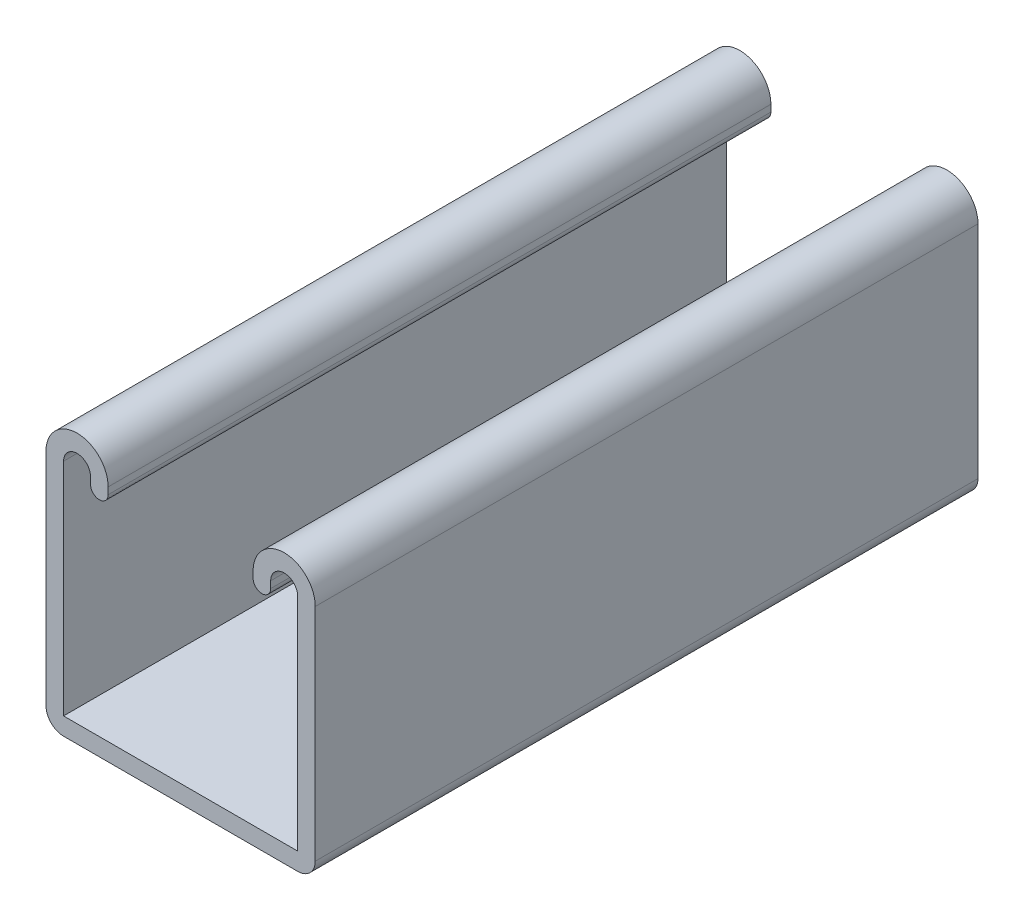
ISO-10303-21;
HEADER;
FILE_DESCRIPTION(('STEP AP214'),'2;1');
FILE_NAME('part.step','',(''),(''),'','','');
FILE_SCHEMA(('AUTOMOTIVE_DESIGN { 1 0 10303 214 1 1 1 1 }'));
ENDSEC;
DATA;
#1=APPLICATION_CONTEXT('core data for automotive mechanical design processes');
#2=APPLICATION_PROTOCOL_DEFINITION('international standard','automotive_design',2000,#1);
#3=PRODUCT_CONTEXT('',#1,'mechanical');
#4=PRODUCT('Part','Part','',(#3));
#5=PRODUCT_RELATED_PRODUCT_CATEGORY('part','',(#4));
#6=PRODUCT_DEFINITION_FORMATION('','',#4);
#7=PRODUCT_DEFINITION_CONTEXT('part definition',#1,'design');
#8=PRODUCT_DEFINITION('design','',#6,#7);
#9=PRODUCT_DEFINITION_SHAPE('','',#8);
#10=(LENGTH_UNIT() NAMED_UNIT(*) SI_UNIT(.MILLI.,.METRE.));
#11=(NAMED_UNIT(*) PLANE_ANGLE_UNIT() SI_UNIT($,.RADIAN.));
#12=(NAMED_UNIT(*) SI_UNIT($,.STERADIAN.) SOLID_ANGLE_UNIT());
#13=UNCERTAINTY_MEASURE_WITH_UNIT(LENGTH_MEASURE(1.E-05),#10,'distance_accuracy_value','');
#14=(GEOMETRIC_REPRESENTATION_CONTEXT(3) GLOBAL_UNCERTAINTY_ASSIGNED_CONTEXT((#13)) GLOBAL_UNIT_ASSIGNED_CONTEXT((#10,
#11,#12)) REPRESENTATION_CONTEXT('',''));
#15=CARTESIAN_POINT('',(0.,0.,0.));
#16=DIRECTION('',(0.,0.,1.));
#17=DIRECTION('',(1.,0.,0.));
#18=AXIS2_PLACEMENT_3D('',#15,#16,#17);
#19=CARTESIAN_POINT('',(-15.875,18.4785,101.6));
#20=DIRECTION('',(0.,0.,-1.));
#21=DIRECTION('',(-1.,0.,0.));
#22=AXIS2_PLACEMENT_3D('',#19,#20,#21);
#23=CYLINDRICAL_SURFACE('',#22,4.7625);
#24=CARTESIAN_POINT('',(-15.875,18.4785,0.));
#25=DIRECTION('',(0.,0.,1.));
#26=DIRECTION('',(-1.,0.,0.));
#27=AXIS2_PLACEMENT_3D('',#24,#25,#26);
#28=CIRCLE('',#27,4.7625);
#29=CARTESIAN_POINT('',(-11.1125,18.4785,0.));
#30=VERTEX_POINT('',#29);
#31=CARTESIAN_POINT('',(-20.6375,18.4785,0.));
#32=VERTEX_POINT('',#31);
#33=EDGE_CURVE('E190',#30,#32,#28,.T.);
#34=ORIENTED_EDGE('',*,*,#33,.T.);
#35=DIRECTION('',(0.,0.,-1.));
#36=VECTOR('',#35,1.);
#37=CARTESIAN_POINT('',(-20.6375,18.4785,101.6));
#38=LINE('',#37,#36);
#39=CARTESIAN_POINT('',(-20.6375,18.4785,101.6));
#40=VERTEX_POINT('',#39);
#41=EDGE_CURVE('E11',#40,#32,#38,.T.);
#42=ORIENTED_EDGE('',*,*,#41,.F.);
#43=CARTESIAN_POINT('',(-15.875,18.4785,101.6));
#44=DIRECTION('',(0.,0.,1.));
#45=DIRECTION('',(-1.,0.,0.));
#46=AXIS2_PLACEMENT_3D('',#43,#44,#45);
#47=CIRCLE('',#46,4.7625);
#48=CARTESIAN_POINT('',(-11.1125,18.4785,101.6));
#49=VERTEX_POINT('',#48);
#50=EDGE_CURVE('E224',#49,#40,#47,.T.);
#51=ORIENTED_EDGE('',*,*,#50,.F.);
#52=DIRECTION('',(0.,0.,-1.));
#53=VECTOR('',#52,1.);
#54=CARTESIAN_POINT('',(-11.1125,18.4785,101.6));
#55=LINE('',#54,#53);
#56=EDGE_CURVE('E186',#49,#30,#55,.T.);
#57=ORIENTED_EDGE('',*,*,#56,.T.);
#58=EDGE_LOOP('',(#34,#42,#51,#57));
#59=FACE_BOUND('',#58,.T.);
#60=ADVANCED_FACE('F33',(#59),#23,.T.);
#61=CARTESIAN_POINT('',(-20.6375,18.4785,101.6));
#62=DIRECTION('',(1.,0.,0.));
#63=DIRECTION('',(0.,1.,0.));
#64=AXIS2_PLACEMENT_3D('',#61,#62,#63);
#65=PLANE('',#64);
#66=DIRECTION('',(0.,-1.,0.));
#67=VECTOR('',#66,1.);
#68=CARTESIAN_POINT('',(-20.6375,18.4785,0.));
#69=LINE('',#68,#67);
#70=CARTESIAN_POINT('',(-20.6375,-15.3416,0.));
#71=VERTEX_POINT('',#70);
#72=EDGE_CURVE('E193',#32,#71,#69,.T.);
#73=ORIENTED_EDGE('',*,*,#72,.T.);
#74=DIRECTION('',(0.,0.,-1.));
#75=VECTOR('',#74,1.);
#76=CARTESIAN_POINT('',(-20.6375,-15.3416,101.6));
#77=LINE('',#76,#75);
#78=CARTESIAN_POINT('',(-20.6375,-15.3416,101.6));
#79=VERTEX_POINT('',#78);
#80=EDGE_CURVE('E42',#79,#71,#77,.T.);
#81=ORIENTED_EDGE('',*,*,#80,.F.);
#82=DIRECTION('',(0.,-1.,0.));
#83=VECTOR('',#82,1.);
#84=CARTESIAN_POINT('',(-20.6375,18.4785,101.6));
#85=LINE('',#84,#83);
#86=EDGE_CURVE('E123',#40,#79,#85,.T.);
#87=ORIENTED_EDGE('',*,*,#86,.F.);
#88=ORIENTED_EDGE('',*,*,#41,.T.);
#89=EDGE_LOOP('',(#73,#81,#87,#88));
#90=FACE_BOUND('',#89,.T.);
#91=ADVANCED_FACE('F333',(#90),#65,.F.);
#92=CARTESIAN_POINT('',(-17.9451,-15.3416,101.6));
#93=DIRECTION('',(0.,0.,-1.));
#94=DIRECTION('',(-1.,0.,0.));
#95=AXIS2_PLACEMENT_3D('',#92,#93,#94);
#96=CYLINDRICAL_SURFACE('',#95,2.6924);
#97=CARTESIAN_POINT('',(-17.9451,-15.3416,0.));
#98=DIRECTION('',(0.,0.,1.));
#99=DIRECTION('',(-1.,0.,0.));
#100=AXIS2_PLACEMENT_3D('',#97,#98,#99);
#101=CIRCLE('',#100,2.6924);
#102=CARTESIAN_POINT('',(-17.9451,-18.034,0.));
#103=VERTEX_POINT('',#102);
#104=EDGE_CURVE('E195',#71,#103,#101,.T.);
#105=ORIENTED_EDGE('',*,*,#104,.T.);
#106=DIRECTION('',(0.,0.,-1.));
#107=VECTOR('',#106,1.);
#108=CARTESIAN_POINT('',(-17.9451,-18.034,101.6));
#109=LINE('',#108,#107);
#110=CARTESIAN_POINT('',(-17.9451,-18.034,101.6));
#111=VERTEX_POINT('',#110);
#112=EDGE_CURVE('E261',#111,#103,#109,.T.);
#113=ORIENTED_EDGE('',*,*,#112,.F.);
#114=CARTESIAN_POINT('',(-17.9451,-15.3416,101.6));
#115=DIRECTION('',(0.,0.,1.));
#116=DIRECTION('',(-1.,0.,0.));
#117=AXIS2_PLACEMENT_3D('',#114,#115,#116);
#118=CIRCLE('',#117,2.6924);
#119=EDGE_CURVE('E270',#79,#111,#118,.T.);
#120=ORIENTED_EDGE('',*,*,#119,.F.);
#121=ORIENTED_EDGE('',*,*,#80,.T.);
#122=EDGE_LOOP('',(#105,#113,#120,#121));
#123=FACE_BOUND('',#122,.T.);
#124=ADVANCED_FACE('F268',(#123),#96,.T.);
#125=CARTESIAN_POINT('',(-17.9451,-18.034,101.6));
#126=DIRECTION('',(0.,1.,0.));
#127=DIRECTION('',(-1.,0.,0.));
#128=AXIS2_PLACEMENT_3D('',#125,#126,#127);
#129=PLANE('',#128);
#130=CARTESIAN_POINT('',(0.,-18.034,71.4375));
#131=DIRECTION('',(0.,-1.,0.));
#132=DIRECTION('',(1.,0.,0.));
#133=AXIS2_PLACEMENT_3D('',#130,#131,#132);
#134=CIRCLE('',#133,7.14375);
#135=CARTESIAN_POINT('',(7.14375,-18.034,71.4375));
#136=VERTEX_POINT('',#135);
#137=EDGE_CURVE('E452',#136,#136,#134,.T.);
#138=ORIENTED_EDGE('',*,*,#137,.F.);
#139=EDGE_LOOP('',(#138));
#140=FACE_BOUND('',#139,.T.);
#141=CARTESIAN_POINT('',(0.,-18.034,23.8125));
#142=DIRECTION('',(0.,-1.,0.));
#143=DIRECTION('',(1.,0.,0.));
#144=AXIS2_PLACEMENT_3D('',#141,#142,#143);
#145=CIRCLE('',#144,7.14375);
#146=CARTESIAN_POINT('',(7.14375,-18.034,23.8125));
#147=VERTEX_POINT('',#146);
#148=EDGE_CURVE('E456',#147,#147,#145,.T.);
#149=ORIENTED_EDGE('',*,*,#148,.F.);
#150=EDGE_LOOP('',(#149));
#151=FACE_BOUND('',#150,.T.);
#152=DIRECTION('',(1.,0.,0.));
#153=VECTOR('',#152,1.);
#154=CARTESIAN_POINT('',(-17.9451,-18.034,0.));
#155=LINE('',#154,#153);
#156=CARTESIAN_POINT('',(17.9451,-18.034,0.));
#157=VERTEX_POINT('',#156);
#158=EDGE_CURVE('E197',#103,#157,#155,.T.);
#159=ORIENTED_EDGE('',*,*,#158,.T.);
#160=DIRECTION('',(0.,0.,-1.));
#161=VECTOR('',#160,1.);
#162=CARTESIAN_POINT('',(17.9451,-18.034,101.6));
#163=LINE('',#162,#161);
#164=CARTESIAN_POINT('',(17.9451,-18.034,101.6));
#165=VERTEX_POINT('',#164);
#166=EDGE_CURVE('E258',#165,#157,#163,.T.);
#167=ORIENTED_EDGE('',*,*,#166,.F.);
#168=DIRECTION('',(1.,0.,0.));
#169=VECTOR('',#168,1.);
#170=CARTESIAN_POINT('',(-17.9451,-18.034,101.6));
#171=LINE('',#170,#169);
#172=EDGE_CURVE('E288',#111,#165,#171,.T.);
#173=ORIENTED_EDGE('',*,*,#172,.F.);
#174=ORIENTED_EDGE('',*,*,#112,.T.);
#175=EDGE_LOOP('',(#159,#167,#173,#174));
#176=FACE_BOUND('',#175,.T.);
#177=ADVANCED_FACE('F279',(#140,#151,#176),#129,.F.);
#178=CARTESIAN_POINT('',(17.9451,-15.3416,101.6));
#179=DIRECTION('',(0.,0.,-1.));
#180=DIRECTION('',(-1.,0.,0.));
#181=AXIS2_PLACEMENT_3D('',#178,#179,#180);
#182=CYLINDRICAL_SURFACE('',#181,2.6924);
#183=CARTESIAN_POINT('',(17.9451,-15.3416,0.));
#184=DIRECTION('',(0.,0.,1.));
#185=DIRECTION('',(1.,0.,0.));
#186=AXIS2_PLACEMENT_3D('',#183,#184,#185);
#187=CIRCLE('',#186,2.6924);
#188=CARTESIAN_POINT('',(20.6375,-15.3416,0.));
#189=VERTEX_POINT('',#188);
#190=EDGE_CURVE('E199',#157,#189,#187,.T.);
#191=ORIENTED_EDGE('',*,*,#190,.T.);
#192=DIRECTION('',(0.,0.,-1.));
#193=VECTOR('',#192,1.);
#194=CARTESIAN_POINT('',(20.6375,-15.3416,101.6));
#195=LINE('',#194,#193);
#196=CARTESIAN_POINT('',(20.6375,-15.3416,101.6));
#197=VERTEX_POINT('',#196);
#198=EDGE_CURVE('E255',#197,#189,#195,.T.);
#199=ORIENTED_EDGE('',*,*,#198,.F.);
#200=CARTESIAN_POINT('',(17.9451,-15.3416,101.6));
#201=DIRECTION('',(0.,0.,1.));
#202=DIRECTION('',(1.,0.,0.));
#203=AXIS2_PLACEMENT_3D('',#200,#201,#202);
#204=CIRCLE('',#203,2.6924);
#205=EDGE_CURVE('E285',#165,#197,#204,.T.);
#206=ORIENTED_EDGE('',*,*,#205,.F.);
#207=ORIENTED_EDGE('',*,*,#166,.T.);
#208=EDGE_LOOP('',(#191,#199,#206,#207));
#209=FACE_BOUND('',#208,.T.);
#210=ADVANCED_FACE('F283',(#209),#182,.T.);
#211=CARTESIAN_POINT('',(20.6375,-15.3416,101.6));
#212=DIRECTION('',(-1.,0.,0.));
#213=DIRECTION('',(0.,0.,1.));
#214=AXIS2_PLACEMENT_3D('',#211,#212,#213);
#215=PLANE('',#214);
#216=DIRECTION('',(0.,1.,0.));
#217=VECTOR('',#216,1.);
#218=CARTESIAN_POINT('',(20.6375,-15.3416,0.));
#219=LINE('',#218,#217);
#220=CARTESIAN_POINT('',(20.6375,18.4785,0.));
#221=VERTEX_POINT('',#220);
#222=EDGE_CURVE('E201',#189,#221,#219,.T.);
#223=ORIENTED_EDGE('',*,*,#222,.T.);
#224=DIRECTION('',(0.,0.,-1.));
#225=VECTOR('',#224,1.);
#226=CARTESIAN_POINT('',(20.6375,18.4785,101.6));
#227=LINE('',#226,#225);
#228=CARTESIAN_POINT('',(20.6375,18.4785,101.6));
#229=VERTEX_POINT('',#228);
#230=EDGE_CURVE('E252',#229,#221,#227,.T.);
#231=ORIENTED_EDGE('',*,*,#230,.F.);
#232=DIRECTION('',(0.,1.,0.));
#233=VECTOR('',#232,1.);
#234=CARTESIAN_POINT('',(20.6375,-15.3416,101.6));
#235=LINE('',#234,#233);
#236=EDGE_CURVE('E287',#197,#229,#235,.T.);
#237=ORIENTED_EDGE('',*,*,#236,.F.);
#238=ORIENTED_EDGE('',*,*,#198,.T.);
#239=EDGE_LOOP('',(#223,#231,#237,#238));
#240=FACE_BOUND('',#239,.T.);
#241=ADVANCED_FACE('F347',(#240),#215,.F.);
#242=CARTESIAN_POINT('',(15.875,18.4785,101.6));
#243=DIRECTION('',(0.,0.,-1.));
#244=DIRECTION('',(-1.,0.,0.));
#245=AXIS2_PLACEMENT_3D('',#242,#243,#244);
#246=CYLINDRICAL_SURFACE('',#245,4.7625);
#247=CARTESIAN_POINT('',(15.875,18.4785,0.));
#248=DIRECTION('',(0.,0.,1.));
#249=DIRECTION('',(1.,0.,0.));
#250=AXIS2_PLACEMENT_3D('',#247,#248,#249);
#251=CIRCLE('',#250,4.7625);
#252=CARTESIAN_POINT('',(11.1125,18.4785,0.));
#253=VERTEX_POINT('',#252);
#254=EDGE_CURVE('E203',#221,#253,#251,.T.);
#255=ORIENTED_EDGE('',*,*,#254,.T.);
#256=DIRECTION('',(0.,0.,-1.));
#257=VECTOR('',#256,1.);
#258=CARTESIAN_POINT('',(11.1125,18.4785,101.6));
#259=LINE('',#258,#257);
#260=CARTESIAN_POINT('',(11.1125,18.4785,101.6));
#261=VERTEX_POINT('',#260);
#262=EDGE_CURVE('E249',#261,#253,#259,.T.);
#263=ORIENTED_EDGE('',*,*,#262,.F.);
#264=CARTESIAN_POINT('',(15.875,18.4785,101.6));
#265=DIRECTION('',(0.,0.,1.));
#266=DIRECTION('',(1.,0.,0.));
#267=AXIS2_PLACEMENT_3D('',#264,#265,#266);
#268=CIRCLE('',#267,4.7625);
#269=EDGE_CURVE('E290',#229,#261,#268,.T.);
#270=ORIENTED_EDGE('',*,*,#269,.F.);
#271=ORIENTED_EDGE('',*,*,#230,.T.);
#272=EDGE_LOOP('',(#255,#263,#270,#271));
#273=FACE_BOUND('',#272,.T.);
#274=ADVANCED_FACE('F350',(#273),#246,.T.);
#275=CARTESIAN_POINT('',(11.1125,18.4785,101.6));
#276=DIRECTION('',(1.,0.,0.));
#277=DIRECTION('',(0.,1.,0.));
#278=AXIS2_PLACEMENT_3D('',#275,#276,#277);
#279=PLANE('',#278);
#280=DIRECTION('',(0.,-1.,0.));
#281=VECTOR('',#280,1.);
#282=CARTESIAN_POINT('',(11.1125,18.4785,0.));
#283=LINE('',#282,#281);
#284=CARTESIAN_POINT('',(11.1125,17.44345,0.));
#285=VERTEX_POINT('',#284);
#286=EDGE_CURVE('E205',#253,#285,#283,.T.);
#287=ORIENTED_EDGE('',*,*,#286,.T.);
#288=DIRECTION('',(0.,0.,-1.));
#289=VECTOR('',#288,1.);
#290=CARTESIAN_POINT('',(11.1125,17.44345,101.6));
#291=LINE('',#290,#289);
#292=CARTESIAN_POINT('',(11.1125,17.44345,101.6));
#293=VERTEX_POINT('',#292);
#294=EDGE_CURVE('E246',#293,#285,#291,.T.);
#295=ORIENTED_EDGE('',*,*,#294,.F.);
#296=DIRECTION('',(0.,-1.,0.));
#297=VECTOR('',#296,1.);
#298=CARTESIAN_POINT('',(11.1125,18.4785,101.6));
#299=LINE('',#298,#297);
#300=EDGE_CURVE('E296',#261,#293,#299,.T.);
#301=ORIENTED_EDGE('',*,*,#300,.F.);
#302=ORIENTED_EDGE('',*,*,#262,.T.);
#303=EDGE_LOOP('',(#287,#295,#301,#302));
#304=FACE_BOUND('',#303,.T.);
#305=ADVANCED_FACE('F354',(#304),#279,.F.);
#306=CARTESIAN_POINT('',(12.4587,17.44345,101.6));
#307=DIRECTION('',(0.,0.,-1.));
#308=DIRECTION('',(-1.,0.,0.));
#309=AXIS2_PLACEMENT_3D('',#306,#307,#308);
#310=CYLINDRICAL_SURFACE('',#309,1.3462);
#311=CARTESIAN_POINT('',(12.4587,17.44345,0.));
#312=DIRECTION('',(0.,0.,1.));
#313=DIRECTION('',(1.,0.,0.));
#314=AXIS2_PLACEMENT_3D('',#311,#312,#313);
#315=CIRCLE('',#314,1.3462);
#316=CARTESIAN_POINT('',(13.8049,17.44345,0.));
#317=VERTEX_POINT('',#316);
#318=EDGE_CURVE('E207',#285,#317,#315,.T.);
#319=ORIENTED_EDGE('',*,*,#318,.T.);
#320=DIRECTION('',(0.,0.,-1.));
#321=VECTOR('',#320,1.);
#322=CARTESIAN_POINT('',(13.8049,17.44345,101.6));
#323=LINE('',#322,#321);
#324=CARTESIAN_POINT('',(13.8049,17.44345,101.6));
#325=VERTEX_POINT('',#324);
#326=EDGE_CURVE('E243',#325,#317,#323,.T.);
#327=ORIENTED_EDGE('',*,*,#326,.F.);
#328=CARTESIAN_POINT('',(12.4587,17.44345,101.6));
#329=DIRECTION('',(0.,0.,1.));
#330=DIRECTION('',(1.,0.,0.));
#331=AXIS2_PLACEMENT_3D('',#328,#329,#330);
#332=CIRCLE('',#331,1.3462);
#333=EDGE_CURVE('E298',#293,#325,#332,.T.);
#334=ORIENTED_EDGE('',*,*,#333,.F.);
#335=ORIENTED_EDGE('',*,*,#294,.T.);
#336=EDGE_LOOP('',(#319,#327,#334,#335));
#337=FACE_BOUND('',#336,.T.);
#338=ADVANCED_FACE('F358',(#337),#310,.T.);
#339=CARTESIAN_POINT('',(13.8049,18.4785,101.6));
#340=DIRECTION('',(-1.,0.,0.));
#341=DIRECTION('',(0.,0.,1.));
#342=AXIS2_PLACEMENT_3D('',#339,#340,#341);
#343=PLANE('',#342);
#344=DIRECTION('',(0.,1.,0.));
#345=VECTOR('',#344,1.);
#346=CARTESIAN_POINT('',(13.8049,18.4785,0.));
#347=LINE('',#346,#345);
#348=CARTESIAN_POINT('',(13.8049,18.4785,0.));
#349=VERTEX_POINT('',#348);
#350=EDGE_CURVE('E209',#317,#349,#347,.T.);
#351=ORIENTED_EDGE('',*,*,#350,.T.);
#352=DIRECTION('',(0.,0.,-1.));
#353=VECTOR('',#352,1.);
#354=CARTESIAN_POINT('',(13.8049,18.4785,101.6));
#355=LINE('',#354,#353);
#356=CARTESIAN_POINT('',(13.8049,18.4785,101.6));
#357=VERTEX_POINT('',#356);
#358=EDGE_CURVE('E240',#357,#349,#355,.T.);
#359=ORIENTED_EDGE('',*,*,#358,.F.);
#360=DIRECTION('',(0.,1.,0.));
#361=VECTOR('',#360,1.);
#362=CARTESIAN_POINT('',(13.8049,18.4785,101.6));
#363=LINE('',#362,#361);
#364=EDGE_CURVE('E300',#325,#357,#363,.T.);
#365=ORIENTED_EDGE('',*,*,#364,.F.);
#366=ORIENTED_EDGE('',*,*,#326,.T.);
#367=EDGE_LOOP('',(#351,#359,#365,#366));
#368=FACE_BOUND('',#367,.T.);
#369=ADVANCED_FACE('F362',(#368),#343,.F.);
#370=CARTESIAN_POINT('',(15.875,18.4785,101.6));
#371=DIRECTION('',(0.,0.,-1.));
#372=DIRECTION('',(-1.,0.,0.));
#373=AXIS2_PLACEMENT_3D('',#370,#371,#372);
#374=CYLINDRICAL_SURFACE('',#373,2.0701);
#375=CARTESIAN_POINT('',(15.875,18.4785,0.));
#376=DIRECTION('',(0.,0.,-1.));
#377=DIRECTION('',(1.,0.,0.));
#378=AXIS2_PLACEMENT_3D('',#375,#376,#377);
#379=CIRCLE('',#378,2.0701);
#380=CARTESIAN_POINT('',(17.9451,18.4785,0.));
#381=VERTEX_POINT('',#380);
#382=EDGE_CURVE('E211',#349,#381,#379,.T.);
#383=ORIENTED_EDGE('',*,*,#382,.T.);
#384=DIRECTION('',(0.,0.,-1.));
#385=VECTOR('',#384,1.);
#386=CARTESIAN_POINT('',(17.9451,18.4785,101.6));
#387=LINE('',#386,#385);
#388=CARTESIAN_POINT('',(17.9451,18.4785,101.6));
#389=VERTEX_POINT('',#388);
#390=EDGE_CURVE('E237',#389,#381,#387,.T.);
#391=ORIENTED_EDGE('',*,*,#390,.F.);
#392=CARTESIAN_POINT('',(15.875,18.4785,101.6));
#393=DIRECTION('',(0.,0.,-1.));
#394=DIRECTION('',(1.,0.,0.));
#395=AXIS2_PLACEMENT_3D('',#392,#393,#394);
#396=CIRCLE('',#395,2.0701);
#397=EDGE_CURVE('E302',#357,#389,#396,.T.);
#398=ORIENTED_EDGE('',*,*,#397,.F.);
#399=ORIENTED_EDGE('',*,*,#358,.T.);
#400=EDGE_LOOP('',(#383,#391,#398,#399));
#401=FACE_BOUND('',#400,.T.);
#402=ADVANCED_FACE('F366',(#401),#374,.F.);
#403=CARTESIAN_POINT('',(17.9451,-15.3416,101.6));
#404=DIRECTION('',(1.,0.,0.));
#405=DIRECTION('',(0.,1.,0.));
#406=AXIS2_PLACEMENT_3D('',#403,#404,#405);
#407=PLANE('',#406);
#408=DIRECTION('',(0.,-1.,0.));
#409=VECTOR('',#408,1.);
#410=CARTESIAN_POINT('',(17.9451,-15.3416,0.));
#411=LINE('',#410,#409);
#412=CARTESIAN_POINT('',(17.9451,-15.3416,0.));
#413=VERTEX_POINT('',#412);
#414=EDGE_CURVE('E213',#381,#413,#411,.T.);
#415=ORIENTED_EDGE('',*,*,#414,.T.);
#416=DIRECTION('',(0.,0.,-1.));
#417=VECTOR('',#416,1.);
#418=CARTESIAN_POINT('',(17.9451,-15.3416,101.6));
#419=LINE('',#418,#417);
#420=CARTESIAN_POINT('',(17.9451,-15.3416,101.6));
#421=VERTEX_POINT('',#420);
#422=EDGE_CURVE('E234',#421,#413,#419,.T.);
#423=ORIENTED_EDGE('',*,*,#422,.F.);
#424=DIRECTION('',(0.,-1.,0.));
#425=VECTOR('',#424,1.);
#426=CARTESIAN_POINT('',(17.9451,-15.3416,101.6));
#427=LINE('',#426,#425);
#428=EDGE_CURVE('E304',#389,#421,#427,.T.);
#429=ORIENTED_EDGE('',*,*,#428,.F.);
#430=ORIENTED_EDGE('',*,*,#390,.T.);
#431=EDGE_LOOP('',(#415,#423,#429,#430));
#432=FACE_BOUND('',#431,.T.);
#433=ADVANCED_FACE('F370',(#432),#407,.F.);
#434=CARTESIAN_POINT('',(-17.9451,-15.3416,101.6));
#435=DIRECTION('',(0.,-1.,0.));
#436=DIRECTION('',(1.,0.,0.));
#437=AXIS2_PLACEMENT_3D('',#434,#435,#436);
#438=PLANE('',#437);
#439=CARTESIAN_POINT('',(0.,-15.3416,71.4375));
#440=DIRECTION('',(0.,-1.,0.));
#441=DIRECTION('',(1.,0.,0.));
#442=AXIS2_PLACEMENT_3D('',#439,#440,#441);
#443=CIRCLE('',#442,7.14375);
#444=CARTESIAN_POINT('',(7.14375,-15.3416,71.4375));
#445=VERTEX_POINT('',#444);
#446=EDGE_CURVE('E455',#445,#445,#443,.T.);
#447=ORIENTED_EDGE('',*,*,#446,.T.);
#448=EDGE_LOOP('',(#447));
#449=FACE_BOUND('',#448,.T.);
#450=CARTESIAN_POINT('',(0.,-15.3416,23.8125));
#451=DIRECTION('',(0.,-1.,0.));
#452=DIRECTION('',(1.,0.,0.));
#453=AXIS2_PLACEMENT_3D('',#450,#451,#452);
#454=CIRCLE('',#453,7.14375);
#455=CARTESIAN_POINT('',(7.14375,-15.3416,23.8125));
#456=VERTEX_POINT('',#455);
#457=EDGE_CURVE('E36',#456,#456,#454,.T.);
#458=ORIENTED_EDGE('',*,*,#457,.T.);
#459=EDGE_LOOP('',(#458));
#460=FACE_BOUND('',#459,.T.);
#461=DIRECTION('',(-1.,0.,0.));
#462=VECTOR('',#461,1.);
#463=CARTESIAN_POINT('',(-17.9451,-15.3416,0.));
#464=LINE('',#463,#462);
#465=CARTESIAN_POINT('',(-17.9451,-15.3416,0.));
#466=VERTEX_POINT('',#465);
#467=EDGE_CURVE('E215',#413,#466,#464,.T.);
#468=ORIENTED_EDGE('',*,*,#467,.T.);
#469=DIRECTION('',(0.,0.,-1.));
#470=VECTOR('',#469,1.);
#471=CARTESIAN_POINT('',(-17.9451,-15.3416,101.6));
#472=LINE('',#471,#470);
#473=CARTESIAN_POINT('',(-17.9451,-15.3416,101.6));
#474=VERTEX_POINT('',#473);
#475=EDGE_CURVE('E231',#474,#466,#472,.T.);
#476=ORIENTED_EDGE('',*,*,#475,.F.);
#477=DIRECTION('',(-1.,0.,0.));
#478=VECTOR('',#477,1.);
#479=CARTESIAN_POINT('',(-17.9451,-15.3416,101.6));
#480=LINE('',#479,#478);
#481=EDGE_CURVE('E306',#421,#474,#480,.T.);
#482=ORIENTED_EDGE('',*,*,#481,.F.);
#483=ORIENTED_EDGE('',*,*,#422,.T.);
#484=EDGE_LOOP('',(#468,#476,#482,#483));
#485=FACE_BOUND('',#484,.T.);
#486=ADVANCED_FACE('F374',(#449,#460,#485),#438,.F.);
#487=CARTESIAN_POINT('',(-17.9451,18.4785,101.6));
#488=DIRECTION('',(-1.,0.,0.));
#489=DIRECTION('',(0.,-1.,0.));
#490=AXIS2_PLACEMENT_3D('',#487,#488,#489);
#491=PLANE('',#490);
#492=DIRECTION('',(0.,1.,0.));
#493=VECTOR('',#492,1.);
#494=CARTESIAN_POINT('',(-17.9451,18.4785,0.));
#495=LINE('',#494,#493);
#496=CARTESIAN_POINT('',(-17.9451,18.4785,0.));
#497=VERTEX_POINT('',#496);
#498=EDGE_CURVE('E217',#466,#497,#495,.T.);
#499=ORIENTED_EDGE('',*,*,#498,.T.);
#500=DIRECTION('',(0.,0.,-1.));
#501=VECTOR('',#500,1.);
#502=CARTESIAN_POINT('',(-17.9451,18.4785,101.6));
#503=LINE('',#502,#501);
#504=CARTESIAN_POINT('',(-17.9451,18.4785,101.6));
#505=VERTEX_POINT('',#504);
#506=EDGE_CURVE('E228',#505,#497,#503,.T.);
#507=ORIENTED_EDGE('',*,*,#506,.F.);
#508=DIRECTION('',(0.,1.,0.));
#509=VECTOR('',#508,1.);
#510=CARTESIAN_POINT('',(-17.9451,18.4785,101.6));
#511=LINE('',#510,#509);
#512=EDGE_CURVE('E308',#474,#505,#511,.T.);
#513=ORIENTED_EDGE('',*,*,#512,.F.);
#514=ORIENTED_EDGE('',*,*,#475,.T.);
#515=EDGE_LOOP('',(#499,#507,#513,#514));
#516=FACE_BOUND('',#515,.T.);
#517=ADVANCED_FACE('F314',(#516),#491,.F.);
#518=CARTESIAN_POINT('',(-15.875,18.4785,101.6));
#519=DIRECTION('',(0.,0.,-1.));
#520=DIRECTION('',(-1.,0.,0.));
#521=AXIS2_PLACEMENT_3D('',#518,#519,#520);
#522=CYLINDRICAL_SURFACE('',#521,2.0701);
#523=CARTESIAN_POINT('',(-15.875,18.4785,0.));
#524=DIRECTION('',(0.,0.,-1.));
#525=DIRECTION('',(-1.,0.,0.));
#526=AXIS2_PLACEMENT_3D('',#523,#524,#525);
#527=CIRCLE('',#526,2.0701);
#528=CARTESIAN_POINT('',(-13.8049,18.4785,0.));
#529=VERTEX_POINT('',#528);
#530=EDGE_CURVE('E219',#497,#529,#527,.T.);
#531=ORIENTED_EDGE('',*,*,#530,.T.);
#532=DIRECTION('',(0.,0.,-1.));
#533=VECTOR('',#532,1.);
#534=CARTESIAN_POINT('',(-13.8049,18.4785,101.6));
#535=LINE('',#534,#533);
#536=CARTESIAN_POINT('',(-13.8049,18.4785,101.6));
#537=VERTEX_POINT('',#536);
#538=EDGE_CURVE('E181',#537,#529,#535,.T.);
#539=ORIENTED_EDGE('',*,*,#538,.F.);
#540=CARTESIAN_POINT('',(-15.875,18.4785,101.6));
#541=DIRECTION('',(0.,0.,-1.));
#542=DIRECTION('',(-1.,0.,0.));
#543=AXIS2_PLACEMENT_3D('',#540,#541,#542);
#544=CIRCLE('',#543,2.0701);
#545=EDGE_CURVE('E172',#505,#537,#544,.T.);
#546=ORIENTED_EDGE('',*,*,#545,.F.);
#547=ORIENTED_EDGE('',*,*,#506,.T.);
#548=EDGE_LOOP('',(#531,#539,#546,#547));
#549=FACE_BOUND('',#548,.T.);
#550=ADVANCED_FACE('F318',(#549),#522,.F.);
#551=CARTESIAN_POINT('',(-13.8049,18.4785,101.6));
#552=DIRECTION('',(1.,0.,0.));
#553=DIRECTION('',(0.,1.,0.));
#554=AXIS2_PLACEMENT_3D('',#551,#552,#553);
#555=PLANE('',#554);
#556=DIRECTION('',(0.,-1.,0.));
#557=VECTOR('',#556,1.);
#558=CARTESIAN_POINT('',(-13.8049,18.4785,0.));
#559=LINE('',#558,#557);
#560=CARTESIAN_POINT('',(-13.8049,17.44345,0.));
#561=VERTEX_POINT('',#560);
#562=EDGE_CURVE('E180',#529,#561,#559,.T.);
#563=ORIENTED_EDGE('',*,*,#562,.T.);
#564=DIRECTION('',(0.,0.,-1.));
#565=VECTOR('',#564,1.);
#566=CARTESIAN_POINT('',(-13.8049,17.44345,101.6));
#567=LINE('',#566,#565);
#568=CARTESIAN_POINT('',(-13.8049,17.44345,101.6));
#569=VERTEX_POINT('',#568);
#570=EDGE_CURVE('E177',#569,#561,#567,.T.);
#571=ORIENTED_EDGE('',*,*,#570,.F.);
#572=DIRECTION('',(0.,-1.,0.));
#573=VECTOR('',#572,1.);
#574=CARTESIAN_POINT('',(-13.8049,18.4785,101.6));
#575=LINE('',#574,#573);
#576=EDGE_CURVE('E166',#537,#569,#575,.T.);
#577=ORIENTED_EDGE('',*,*,#576,.F.);
#578=ORIENTED_EDGE('',*,*,#538,.T.);
#579=EDGE_LOOP('',(#563,#571,#577,#578));
#580=FACE_BOUND('',#579,.T.);
#581=ADVANCED_FACE('F178',(#580),#555,.F.);
#582=CARTESIAN_POINT('',(-12.4587,17.44345,101.6));
#583=DIRECTION('',(0.,0.,-1.));
#584=DIRECTION('',(-1.,0.,0.));
#585=AXIS2_PLACEMENT_3D('',#582,#583,#584);
#586=CYLINDRICAL_SURFACE('',#585,1.3462);
#587=CARTESIAN_POINT('',(-12.4587,17.44345,0.));
#588=DIRECTION('',(0.,0.,1.));
#589=DIRECTION('',(-1.,0.,0.));
#590=AXIS2_PLACEMENT_3D('',#587,#588,#589);
#591=CIRCLE('',#590,1.3462);
#592=CARTESIAN_POINT('',(-11.1125,17.44345,0.));
#593=VERTEX_POINT('',#592);
#594=EDGE_CURVE('E109',#561,#593,#591,.T.);
#595=ORIENTED_EDGE('',*,*,#594,.T.);
#596=DIRECTION('',(0.,0.,-1.));
#597=VECTOR('',#596,1.);
#598=CARTESIAN_POINT('',(-11.1125,17.44345,101.6));
#599=LINE('',#598,#597);
#600=CARTESIAN_POINT('',(-11.1125,17.44345,101.6));
#601=VERTEX_POINT('',#600);
#602=EDGE_CURVE('E182',#601,#593,#599,.T.);
#603=ORIENTED_EDGE('',*,*,#602,.F.);
#604=CARTESIAN_POINT('',(-12.4587,17.44345,101.6));
#605=DIRECTION('',(0.,0.,1.));
#606=DIRECTION('',(-1.,0.,0.));
#607=AXIS2_PLACEMENT_3D('',#604,#605,#606);
#608=CIRCLE('',#607,1.3462);
#609=EDGE_CURVE('E170',#569,#601,#608,.T.);
#610=ORIENTED_EDGE('',*,*,#609,.F.);
#611=ORIENTED_EDGE('',*,*,#570,.T.);
#612=EDGE_LOOP('',(#595,#603,#610,#611));
#613=FACE_BOUND('',#612,.T.);
#614=ADVANCED_FACE('F184',(#613),#586,.T.);
#615=CARTESIAN_POINT('',(-11.1125,18.4785,101.6));
#616=DIRECTION('',(-1.,0.,0.));
#617=DIRECTION('',(0.,0.,1.));
#618=AXIS2_PLACEMENT_3D('',#615,#616,#617);
#619=PLANE('',#618);
#620=DIRECTION('',(0.,1.,0.));
#621=VECTOR('',#620,1.);
#622=CARTESIAN_POINT('',(-11.1125,18.4785,0.));
#623=LINE('',#622,#621);
#624=EDGE_CURVE('E115',#593,#30,#623,.T.);
#625=ORIENTED_EDGE('',*,*,#624,.T.);
#626=ORIENTED_EDGE('',*,*,#56,.F.);
#627=DIRECTION('',(0.,1.,0.));
#628=VECTOR('',#627,1.);
#629=CARTESIAN_POINT('',(-11.1125,18.4785,101.6));
#630=LINE('',#629,#628);
#631=EDGE_CURVE('E50',#601,#49,#630,.T.);
#632=ORIENTED_EDGE('',*,*,#631,.F.);
#633=ORIENTED_EDGE('',*,*,#602,.T.);
#634=EDGE_LOOP('',(#625,#626,#632,#633));
#635=FACE_BOUND('',#634,.T.);
#636=ADVANCED_FACE('F322',(#635),#619,.F.);
#637=CARTESIAN_POINT('',(-15.875,18.4785,101.6));
#638=DIRECTION('',(0.,0.,-1.));
#639=DIRECTION('',(-1.,0.,0.));
#640=AXIS2_PLACEMENT_3D('',#637,#638,#639);
#641=PLANE('',#640);
#642=ORIENTED_EDGE('',*,*,#50,.T.);
#643=ORIENTED_EDGE('',*,*,#86,.T.);
#644=ORIENTED_EDGE('',*,*,#119,.T.);
#645=ORIENTED_EDGE('',*,*,#172,.T.);
#646=ORIENTED_EDGE('',*,*,#205,.T.);
#647=ORIENTED_EDGE('',*,*,#236,.T.);
#648=ORIENTED_EDGE('',*,*,#269,.T.);
#649=ORIENTED_EDGE('',*,*,#300,.T.);
#650=ORIENTED_EDGE('',*,*,#333,.T.);
#651=ORIENTED_EDGE('',*,*,#364,.T.);
#652=ORIENTED_EDGE('',*,*,#397,.T.);
#653=ORIENTED_EDGE('',*,*,#428,.T.);
#654=ORIENTED_EDGE('',*,*,#481,.T.);
#655=ORIENTED_EDGE('',*,*,#512,.T.);
#656=ORIENTED_EDGE('',*,*,#545,.T.);
#657=ORIENTED_EDGE('',*,*,#576,.T.);
#658=ORIENTED_EDGE('',*,*,#609,.T.);
#659=ORIENTED_EDGE('',*,*,#631,.T.);
#660=EDGE_LOOP('',(#642,#643,#644,#645,#646,#647,#648,#649,#650,#651,#652,#653,#654,#655,#656,
#657,#658,#659));
#661=FACE_BOUND('',#660,.T.);
#662=ADVANCED_FACE('F168',(#661),#641,.F.);
#663=CARTESIAN_POINT('',(-15.875,18.4785,0.));
#664=DIRECTION('',(0.,0.,-1.));
#665=DIRECTION('',(-1.,0.,0.));
#666=AXIS2_PLACEMENT_3D('',#663,#664,#665);
#667=PLANE('',#666);
#668=ORIENTED_EDGE('',*,*,#33,.F.);
#669=ORIENTED_EDGE('',*,*,#624,.F.);
#670=ORIENTED_EDGE('',*,*,#594,.F.);
#671=ORIENTED_EDGE('',*,*,#562,.F.);
#672=ORIENTED_EDGE('',*,*,#530,.F.);
#673=ORIENTED_EDGE('',*,*,#498,.F.);
#674=ORIENTED_EDGE('',*,*,#467,.F.);
#675=ORIENTED_EDGE('',*,*,#414,.F.);
#676=ORIENTED_EDGE('',*,*,#382,.F.);
#677=ORIENTED_EDGE('',*,*,#350,.F.);
#678=ORIENTED_EDGE('',*,*,#318,.F.);
#679=ORIENTED_EDGE('',*,*,#286,.F.);
#680=ORIENTED_EDGE('',*,*,#254,.F.);
#681=ORIENTED_EDGE('',*,*,#222,.F.);
#682=ORIENTED_EDGE('',*,*,#190,.F.);
#683=ORIENTED_EDGE('',*,*,#158,.F.);
#684=ORIENTED_EDGE('',*,*,#104,.F.);
#685=ORIENTED_EDGE('',*,*,#72,.F.);
#686=EDGE_LOOP('',(#668,#669,#670,#671,#672,#673,#674,#675,#676,#677,#678,#679,#680,#681,#682,
#683,#684,#685));
#687=FACE_BOUND('',#686,.T.);
#688=ADVANCED_FACE('F274',(#687),#667,.T.);
#689=CARTESIAN_POINT('',(0.,23.241,23.8125));
#690=DIRECTION('',(0.,-1.,0.));
#691=DIRECTION('',(1.,0.,0.));
#692=AXIS2_PLACEMENT_3D('',#689,#690,#691);
#693=CYLINDRICAL_SURFACE('',#692,7.14375);
#694=ORIENTED_EDGE('',*,*,#148,.T.);
#695=EDGE_LOOP('',(#694));
#696=FACE_BOUND('',#695,.T.);
#697=ORIENTED_EDGE('',*,*,#457,.F.);
#698=EDGE_LOOP('',(#697));
#699=FACE_BOUND('',#698,.T.);
#700=ADVANCED_FACE('F411',(#696,#699),#693,.F.);
#701=CARTESIAN_POINT('',(0.,23.241,71.4375));
#702=DIRECTION('',(0.,-1.,0.));
#703=DIRECTION('',(1.,0.,0.));
#704=AXIS2_PLACEMENT_3D('',#701,#702,#703);
#705=CYLINDRICAL_SURFACE('',#704,7.14375);
#706=ORIENTED_EDGE('',*,*,#137,.T.);
#707=EDGE_LOOP('',(#706));
#708=FACE_BOUND('',#707,.T.);
#709=ORIENTED_EDGE('',*,*,#446,.F.);
#710=EDGE_LOOP('',(#709));
#711=FACE_BOUND('',#710,.T.);
#712=ADVANCED_FACE('F419',(#708,#711),#705,.F.);
#713=CLOSED_SHELL('',(#60,#91,#124,#177,#210,#241,#274,#305,#338,#369,#402,#433,#486,#517,#550,
#581,#614,#636,#662,#688,#700,#712));
#714=MANIFOLD_SOLID_BREP('B2',#713);
#715=ADVANCED_BREP_SHAPE_REPRESENTATION('',(#18,#714),#14);
#716=SHAPE_DEFINITION_REPRESENTATION(#9,#715);
ENDSEC;
END-ISO-10303-21;
